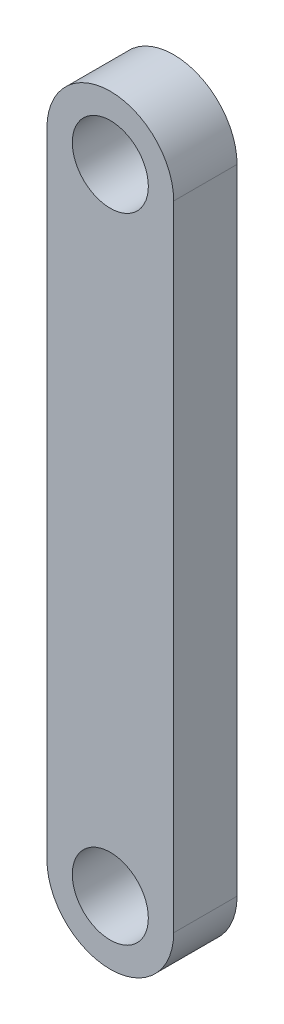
ISO-10303-21;
HEADER;
FILE_DESCRIPTION(('STEP AP214'),'2;1');
FILE_NAME('part.step','',(''),(''),'','','');
FILE_SCHEMA(('AUTOMOTIVE_DESIGN { 1 0 10303 214 1 1 1 1 }'));
ENDSEC;
DATA;
#1=APPLICATION_CONTEXT('core data for automotive mechanical design processes');
#2=APPLICATION_PROTOCOL_DEFINITION('international standard','automotive_design',2000,#1);
#3=PRODUCT_CONTEXT('',#1,'mechanical');
#4=PRODUCT('Part','Part','',(#3));
#5=PRODUCT_RELATED_PRODUCT_CATEGORY('part','',(#4));
#6=PRODUCT_DEFINITION_FORMATION('','',#4);
#7=PRODUCT_DEFINITION_CONTEXT('part definition',#1,'design');
#8=PRODUCT_DEFINITION('design','',#6,#7);
#9=PRODUCT_DEFINITION_SHAPE('','',#8);
#10=(LENGTH_UNIT() NAMED_UNIT(*) SI_UNIT(.MILLI.,.METRE.));
#11=(NAMED_UNIT(*) PLANE_ANGLE_UNIT() SI_UNIT($,.RADIAN.));
#12=(NAMED_UNIT(*) SI_UNIT($,.STERADIAN.) SOLID_ANGLE_UNIT());
#13=UNCERTAINTY_MEASURE_WITH_UNIT(LENGTH_MEASURE(1.E-05),#10,'distance_accuracy_value','');
#14=(GEOMETRIC_REPRESENTATION_CONTEXT(3) GLOBAL_UNCERTAINTY_ASSIGNED_CONTEXT((#13)) GLOBAL_UNIT_ASSIGNED_CONTEXT((#10,
#11,#12)) REPRESENTATION_CONTEXT('',''));
#15=CARTESIAN_POINT('',(0.,0.,0.));
#16=DIRECTION('',(0.,0.,1.));
#17=DIRECTION('',(1.,0.,0.));
#18=AXIS2_PLACEMENT_3D('',#15,#16,#17);
#19=CARTESIAN_POINT('',(0.,0.,2.5));
#20=DIRECTION('',(0.,0.,-1.));
#21=DIRECTION('',(-1.,0.,0.));
#22=AXIS2_PLACEMENT_3D('',#19,#20,#21);
#23=PLANE('',#22);
#24=CARTESIAN_POINT('',(0.,50.,2.5));
#25=DIRECTION('',(0.,0.,1.));
#26=DIRECTION('',(1.,0.,0.));
#27=AXIS2_PLACEMENT_3D('',#24,#25,#26);
#28=CIRCLE('',#27,3.);
#29=CARTESIAN_POINT('',(3.,50.,2.5));
#30=VERTEX_POINT('',#29);
#31=EDGE_CURVE('E92',#30,#30,#28,.T.);
#32=ORIENTED_EDGE('',*,*,#31,.F.);
#33=EDGE_LOOP('',(#32));
#34=FACE_BOUND('',#33,.T.);
#35=CARTESIAN_POINT('',(0.,0.,2.5));
#36=DIRECTION('',(0.,0.,1.));
#37=DIRECTION('',(-1.,0.,0.));
#38=AXIS2_PLACEMENT_3D('',#35,#36,#37);
#39=CIRCLE('',#38,5.);
#40=CARTESIAN_POINT('',(-5.,0.,2.5));
#41=VERTEX_POINT('',#40);
#42=CARTESIAN_POINT('',(5.,0.,2.5));
#43=VERTEX_POINT('',#42);
#44=EDGE_CURVE('E102',#41,#43,#39,.T.);
#45=ORIENTED_EDGE('',*,*,#44,.T.);
#46=DIRECTION('',(0.,1.,0.));
#47=VECTOR('',#46,1.);
#48=CARTESIAN_POINT('',(5.,0.,2.5));
#49=LINE('',#48,#47);
#50=CARTESIAN_POINT('',(5.,50.,2.5));
#51=VERTEX_POINT('',#50);
#52=EDGE_CURVE('E87',#43,#51,#49,.T.);
#53=ORIENTED_EDGE('',*,*,#52,.T.);
#54=CARTESIAN_POINT('',(0.,50.,2.5));
#55=DIRECTION('',(0.,0.,1.));
#56=DIRECTION('',(1.,0.,0.));
#57=AXIS2_PLACEMENT_3D('',#54,#55,#56);
#58=CIRCLE('',#57,5.);
#59=CARTESIAN_POINT('',(-5.,50.,2.5));
#60=VERTEX_POINT('',#59);
#61=EDGE_CURVE('E53',#51,#60,#58,.T.);
#62=ORIENTED_EDGE('',*,*,#61,.T.);
#63=DIRECTION('',(0.,-1.,0.));
#64=VECTOR('',#63,1.);
#65=CARTESIAN_POINT('',(-5.,0.,2.5));
#66=LINE('',#65,#64);
#67=EDGE_CURVE('E48',#60,#41,#66,.T.);
#68=ORIENTED_EDGE('',*,*,#67,.T.);
#69=EDGE_LOOP('',(#45,#53,#62,#68));
#70=FACE_BOUND('',#69,.T.);
#71=CARTESIAN_POINT('',(0.,0.,2.5));
#72=DIRECTION('',(0.,0.,1.));
#73=DIRECTION('',(1.,0.,0.));
#74=AXIS2_PLACEMENT_3D('',#71,#72,#73);
#75=CIRCLE('',#74,3.);
#76=CARTESIAN_POINT('',(3.,0.,2.5));
#77=VERTEX_POINT('',#76);
#78=EDGE_CURVE('E120',#77,#77,#75,.T.);
#79=ORIENTED_EDGE('',*,*,#78,.F.);
#80=EDGE_LOOP('',(#79));
#81=FACE_BOUND('',#80,.T.);
#82=ADVANCED_FACE('F33',(#34,#70,#81),#23,.F.);
#83=CARTESIAN_POINT('',(0.,0.,-2.5));
#84=DIRECTION('',(0.,0.,-1.));
#85=DIRECTION('',(-1.,0.,0.));
#86=AXIS2_PLACEMENT_3D('',#83,#84,#85);
#87=PLANE('',#86);
#88=CARTESIAN_POINT('',(0.,50.,-2.5));
#89=DIRECTION('',(0.,0.,1.));
#90=DIRECTION('',(1.,0.,0.));
#91=AXIS2_PLACEMENT_3D('',#88,#89,#90);
#92=CIRCLE('',#91,3.);
#93=CARTESIAN_POINT('',(3.,50.,-2.5));
#94=VERTEX_POINT('',#93);
#95=EDGE_CURVE('E95',#94,#94,#92,.T.);
#96=ORIENTED_EDGE('',*,*,#95,.T.);
#97=EDGE_LOOP('',(#96));
#98=FACE_BOUND('',#97,.T.);
#99=CARTESIAN_POINT('',(0.,0.,-2.5));
#100=DIRECTION('',(0.,0.,1.));
#101=DIRECTION('',(-1.,0.,0.));
#102=AXIS2_PLACEMENT_3D('',#99,#100,#101);
#103=CIRCLE('',#102,5.);
#104=CARTESIAN_POINT('',(-5.,0.,-2.5));
#105=VERTEX_POINT('',#104);
#106=CARTESIAN_POINT('',(5.,0.,-2.5));
#107=VERTEX_POINT('',#106);
#108=EDGE_CURVE('E79',#105,#107,#103,.T.);
#109=ORIENTED_EDGE('',*,*,#108,.F.);
#110=DIRECTION('',(0.,-1.,0.));
#111=VECTOR('',#110,1.);
#112=CARTESIAN_POINT('',(-5.,0.,-2.5));
#113=LINE('',#112,#111);
#114=CARTESIAN_POINT('',(-5.,50.,-2.5));
#115=VERTEX_POINT('',#114);
#116=EDGE_CURVE('E100',#115,#105,#113,.T.);
#117=ORIENTED_EDGE('',*,*,#116,.F.);
#118=CARTESIAN_POINT('',(0.,50.,-2.5));
#119=DIRECTION('',(0.,0.,1.));
#120=DIRECTION('',(1.,0.,0.));
#121=AXIS2_PLACEMENT_3D('',#118,#119,#120);
#122=CIRCLE('',#121,5.);
#123=CARTESIAN_POINT('',(5.,50.,-2.5));
#124=VERTEX_POINT('',#123);
#125=EDGE_CURVE('E80',#124,#115,#122,.T.);
#126=ORIENTED_EDGE('',*,*,#125,.F.);
#127=DIRECTION('',(0.,1.,0.));
#128=VECTOR('',#127,1.);
#129=CARTESIAN_POINT('',(5.,0.,-2.5));
#130=LINE('',#129,#128);
#131=EDGE_CURVE('E74',#107,#124,#130,.T.);
#132=ORIENTED_EDGE('',*,*,#131,.F.);
#133=EDGE_LOOP('',(#109,#117,#126,#132));
#134=FACE_BOUND('',#133,.T.);
#135=CARTESIAN_POINT('',(0.,0.,-2.5));
#136=DIRECTION('',(0.,0.,1.));
#137=DIRECTION('',(1.,0.,0.));
#138=AXIS2_PLACEMENT_3D('',#135,#136,#137);
#139=CIRCLE('',#138,3.);
#140=CARTESIAN_POINT('',(3.,0.,-2.5));
#141=VERTEX_POINT('',#140);
#142=EDGE_CURVE('E122',#141,#141,#139,.T.);
#143=ORIENTED_EDGE('',*,*,#142,.T.);
#144=EDGE_LOOP('',(#143));
#145=FACE_BOUND('',#144,.T.);
#146=ADVANCED_FACE('F75',(#98,#134,#145),#87,.T.);
#147=CARTESIAN_POINT('',(0.,0.,2.5));
#148=DIRECTION('',(0.,0.,-1.));
#149=DIRECTION('',(-1.,0.,0.));
#150=AXIS2_PLACEMENT_3D('',#147,#148,#149);
#151=CYLINDRICAL_SURFACE('',#150,5.);
#152=ORIENTED_EDGE('',*,*,#108,.T.);
#153=DIRECTION('',(0.,0.,-1.));
#154=VECTOR('',#153,1.);
#155=CARTESIAN_POINT('',(5.,0.,2.5));
#156=LINE('',#155,#154);
#157=EDGE_CURVE('E11',#43,#107,#156,.T.);
#158=ORIENTED_EDGE('',*,*,#157,.F.);
#159=ORIENTED_EDGE('',*,*,#44,.F.);
#160=DIRECTION('',(0.,0.,-1.));
#161=VECTOR('',#160,1.);
#162=CARTESIAN_POINT('',(-5.,0.,2.5));
#163=LINE('',#162,#161);
#164=EDGE_CURVE('E91',#41,#105,#163,.T.);
#165=ORIENTED_EDGE('',*,*,#164,.T.);
#166=EDGE_LOOP('',(#152,#158,#159,#165));
#167=FACE_BOUND('',#166,.T.);
#168=ADVANCED_FACE('F35',(#167),#151,.T.);
#169=CARTESIAN_POINT('',(5.,0.,2.5));
#170=DIRECTION('',(-1.,0.,0.));
#171=DIRECTION('',(0.,0.,1.));
#172=AXIS2_PLACEMENT_3D('',#169,#170,#171);
#173=PLANE('',#172);
#174=ORIENTED_EDGE('',*,*,#131,.T.);
#175=DIRECTION('',(0.,0.,-1.));
#176=VECTOR('',#175,1.);
#177=CARTESIAN_POINT('',(5.,50.,2.5));
#178=LINE('',#177,#176);
#179=EDGE_CURVE('E41',#51,#124,#178,.T.);
#180=ORIENTED_EDGE('',*,*,#179,.F.);
#181=ORIENTED_EDGE('',*,*,#52,.F.);
#182=ORIENTED_EDGE('',*,*,#157,.T.);
#183=EDGE_LOOP('',(#174,#180,#181,#182));
#184=FACE_BOUND('',#183,.T.);
#185=ADVANCED_FACE('F86',(#184),#173,.F.);
#186=CARTESIAN_POINT('',(0.,50.,2.5));
#187=DIRECTION('',(0.,0.,-1.));
#188=DIRECTION('',(-1.,0.,0.));
#189=AXIS2_PLACEMENT_3D('',#186,#187,#188);
#190=CYLINDRICAL_SURFACE('',#189,5.);
#191=ORIENTED_EDGE('',*,*,#125,.T.);
#192=DIRECTION('',(0.,0.,-1.));
#193=VECTOR('',#192,1.);
#194=CARTESIAN_POINT('',(-5.,50.,2.5));
#195=LINE('',#194,#193);
#196=EDGE_CURVE('E108',#60,#115,#195,.T.);
#197=ORIENTED_EDGE('',*,*,#196,.F.);
#198=ORIENTED_EDGE('',*,*,#61,.F.);
#199=ORIENTED_EDGE('',*,*,#179,.T.);
#200=EDGE_LOOP('',(#191,#197,#198,#199));
#201=FACE_BOUND('',#200,.T.);
#202=ADVANCED_FACE('F111',(#201),#190,.T.);
#203=CARTESIAN_POINT('',(-5.,0.,2.5));
#204=DIRECTION('',(1.,0.,0.));
#205=DIRECTION('',(0.,0.,-1.));
#206=AXIS2_PLACEMENT_3D('',#203,#204,#205);
#207=PLANE('',#206);
#208=ORIENTED_EDGE('',*,*,#116,.T.);
#209=ORIENTED_EDGE('',*,*,#164,.F.);
#210=ORIENTED_EDGE('',*,*,#67,.F.);
#211=ORIENTED_EDGE('',*,*,#196,.T.);
#212=EDGE_LOOP('',(#208,#209,#210,#211));
#213=FACE_BOUND('',#212,.T.);
#214=ADVANCED_FACE('F113',(#213),#207,.F.);
#215=CARTESIAN_POINT('',(0.,50.,2.5));
#216=DIRECTION('',(0.,0.,-1.));
#217=DIRECTION('',(-1.,0.,0.));
#218=AXIS2_PLACEMENT_3D('',#215,#216,#217);
#219=CYLINDRICAL_SURFACE('',#218,3.);
#220=ORIENTED_EDGE('',*,*,#31,.T.);
#221=EDGE_LOOP('',(#220));
#222=FACE_BOUND('',#221,.T.);
#223=ORIENTED_EDGE('',*,*,#95,.F.);
#224=EDGE_LOOP('',(#223));
#225=FACE_BOUND('',#224,.T.);
#226=ADVANCED_FACE('F131',(#222,#225),#219,.F.);
#227=CARTESIAN_POINT('',(0.,0.,2.5));
#228=DIRECTION('',(0.,0.,-1.));
#229=DIRECTION('',(-1.,0.,0.));
#230=AXIS2_PLACEMENT_3D('',#227,#228,#229);
#231=CYLINDRICAL_SURFACE('',#230,3.);
#232=ORIENTED_EDGE('',*,*,#78,.T.);
#233=EDGE_LOOP('',(#232));
#234=FACE_BOUND('',#233,.T.);
#235=ORIENTED_EDGE('',*,*,#142,.F.);
#236=EDGE_LOOP('',(#235));
#237=FACE_BOUND('',#236,.T.);
#238=ADVANCED_FACE('F129',(#234,#237),#231,.F.);
#239=CLOSED_SHELL('',(#82,#146,#168,#185,#202,#214,#226,#238));
#240=MANIFOLD_SOLID_BREP('B2',#239);
#241=ADVANCED_BREP_SHAPE_REPRESENTATION('',(#18,#240),#14);
#242=SHAPE_DEFINITION_REPRESENTATION(#9,#241);
ENDSEC;
END-ISO-10303-21;
